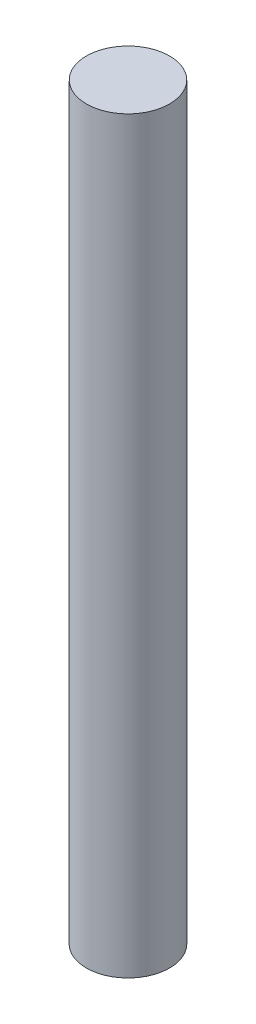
from build123d import *

# Parameters (mm, degrees)
ESQUISSE1_R      = 0.25
EXTRUSION1_DEPTH = 4.5


with BuildPart() as part:
    # Esquisse1 → Extrusion1 (new body)
    with BuildSketch(Plane(origin=(0, 0, 0), x_dir=(1, 0, 0), z_dir=(0, 1, 0))):
        with Locations(Location((0, 0, 0), (0, 0, 270))):
            Circle(ESQUISSE1_R)
    extrude(amount=EXTRUSION1_DEPTH)


solid = part.part
